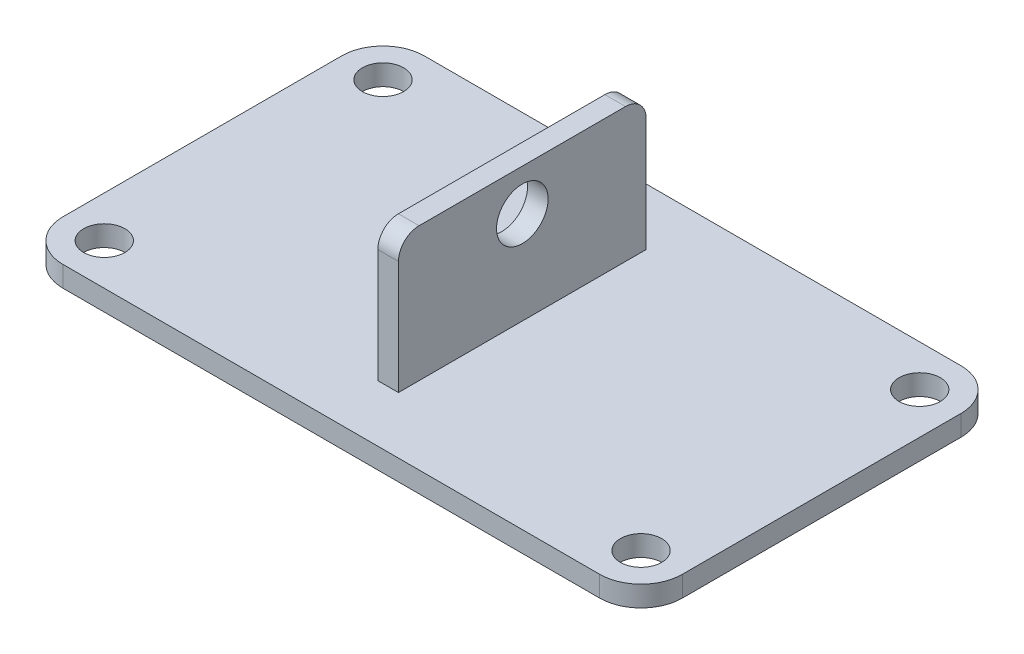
ISO-10303-21;
HEADER;
FILE_DESCRIPTION(('STEP AP214'),'2;1');
FILE_NAME('part.step','',(''),(''),'','','');
FILE_SCHEMA(('AUTOMOTIVE_DESIGN { 1 0 10303 214 1 1 1 1 }'));
ENDSEC;
DATA;
#1=APPLICATION_CONTEXT('core data for automotive mechanical design processes');
#2=APPLICATION_PROTOCOL_DEFINITION('international standard','automotive_design',2000,#1);
#3=PRODUCT_CONTEXT('',#1,'mechanical');
#4=PRODUCT('Part','Part','',(#3));
#5=PRODUCT_RELATED_PRODUCT_CATEGORY('part','',(#4));
#6=PRODUCT_DEFINITION_FORMATION('','',#4);
#7=PRODUCT_DEFINITION_CONTEXT('part definition',#1,'design');
#8=PRODUCT_DEFINITION('design','',#6,#7);
#9=PRODUCT_DEFINITION_SHAPE('','',#8);
#10=(LENGTH_UNIT() NAMED_UNIT(*) SI_UNIT(.MILLI.,.METRE.));
#11=(NAMED_UNIT(*) PLANE_ANGLE_UNIT() SI_UNIT($,.RADIAN.));
#12=(NAMED_UNIT(*) SI_UNIT($,.STERADIAN.) SOLID_ANGLE_UNIT());
#13=UNCERTAINTY_MEASURE_WITH_UNIT(LENGTH_MEASURE(1.E-05),#10,'distance_accuracy_value','');
#14=(GEOMETRIC_REPRESENTATION_CONTEXT(3) GLOBAL_UNCERTAINTY_ASSIGNED_CONTEXT((#13)) GLOBAL_UNIT_ASSIGNED_CONTEXT((#10,
#11,#12)) REPRESENTATION_CONTEXT('',''));
#15=CARTESIAN_POINT('',(0.,0.,0.));
#16=DIRECTION('',(0.,0.,1.));
#17=DIRECTION('',(1.,0.,0.));
#18=AXIS2_PLACEMENT_3D('',#15,#16,#17);
#19=CARTESIAN_POINT('',(130.,10.,-67.5));
#20=DIRECTION('',(0.,1.,0.));
#21=DIRECTION('',(0.,0.,1.));
#22=AXIS2_PLACEMENT_3D('',#19,#20,#21);
#23=PLANE('',#22);
#24=CARTESIAN_POINT('',(-130.,10.,-67.5));
#25=DIRECTION('',(0.,1.,0.));
#26=DIRECTION('',(0.,0.,1.));
#27=AXIS2_PLACEMENT_3D('',#24,#25,#26);
#28=CIRCLE('',#27,9.99999999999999);
#29=CARTESIAN_POINT('',(-130.,10.,-57.5));
#30=VERTEX_POINT('',#29);
#31=EDGE_CURVE('E240',#30,#30,#28,.T.);
#32=ORIENTED_EDGE('',*,*,#31,.F.);
#33=EDGE_LOOP('',(#32));
#34=FACE_BOUND('',#33,.T.);
#35=CARTESIAN_POINT('',(130.,10.,-67.5));
#36=DIRECTION('',(0.,1.,0.));
#37=DIRECTION('',(0.,0.,1.));
#38=AXIS2_PLACEMENT_3D('',#35,#36,#37);
#39=CIRCLE('',#38,10.);
#40=CARTESIAN_POINT('',(130.,10.,-57.5));
#41=VERTEX_POINT('',#40);
#42=EDGE_CURVE('E164',#41,#41,#39,.T.);
#43=ORIENTED_EDGE('',*,*,#42,.F.);
#44=EDGE_LOOP('',(#43));
#45=FACE_BOUND('',#44,.T.);
#46=CARTESIAN_POINT('',(130.,10.,-67.5));
#47=DIRECTION('',(0.,1.,0.));
#48=DIRECTION('',(0.,0.,1.));
#49=AXIS2_PLACEMENT_3D('',#46,#47,#48);
#50=CIRCLE('',#49,20.);
#51=CARTESIAN_POINT('',(150.,10.,-67.4999999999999));
#52=VERTEX_POINT('',#51);
#53=CARTESIAN_POINT('',(130.,10.,-87.5));
#54=VERTEX_POINT('',#53);
#55=EDGE_CURVE('E183',#52,#54,#50,.T.);
#56=ORIENTED_EDGE('',*,*,#55,.T.);
#57=DIRECTION('',(-1.,0.,0.));
#58=VECTOR('',#57,1.);
#59=CARTESIAN_POINT('',(-130.,10.,-87.5));
#60=LINE('',#59,#58);
#61=CARTESIAN_POINT('',(-130.,10.,-87.5));
#62=VERTEX_POINT('',#61);
#63=EDGE_CURVE('E111',#54,#62,#60,.T.);
#64=ORIENTED_EDGE('',*,*,#63,.T.);
#65=CARTESIAN_POINT('',(-130.,10.,-67.5));
#66=DIRECTION('',(0.,1.,0.));
#67=DIRECTION('',(0.,0.,1.));
#68=AXIS2_PLACEMENT_3D('',#65,#66,#67);
#69=CIRCLE('',#68,20.);
#70=CARTESIAN_POINT('',(-150.,10.,-67.4999999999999));
#71=VERTEX_POINT('',#70);
#72=EDGE_CURVE('E204',#62,#71,#69,.T.);
#73=ORIENTED_EDGE('',*,*,#72,.T.);
#74=DIRECTION('',(0.,0.,1.));
#75=VECTOR('',#74,1.);
#76=CARTESIAN_POINT('',(-150.,10.,67.4999999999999));
#77=LINE('',#76,#75);
#78=CARTESIAN_POINT('',(-150.,10.,67.4999999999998));
#79=VERTEX_POINT('',#78);
#80=EDGE_CURVE('E218',#71,#79,#77,.T.);
#81=ORIENTED_EDGE('',*,*,#80,.T.);
#82=CARTESIAN_POINT('',(-130.,10.,67.5));
#83=DIRECTION('',(0.,1.,0.));
#84=DIRECTION('',(0.,0.,1.));
#85=AXIS2_PLACEMENT_3D('',#82,#83,#84);
#86=CIRCLE('',#85,20.);
#87=CARTESIAN_POINT('',(-130.,10.,87.5));
#88=VERTEX_POINT('',#87);
#89=EDGE_CURVE('E134',#79,#88,#86,.T.);
#90=ORIENTED_EDGE('',*,*,#89,.T.);
#91=DIRECTION('',(1.,0.,0.));
#92=VECTOR('',#91,1.);
#93=CARTESIAN_POINT('',(-130.,10.,87.5));
#94=LINE('',#93,#92);
#95=CARTESIAN_POINT('',(130.,10.,87.5));
#96=VERTEX_POINT('',#95);
#97=EDGE_CURVE('E127',#88,#96,#94,.T.);
#98=ORIENTED_EDGE('',*,*,#97,.T.);
#99=CARTESIAN_POINT('',(130.,10.,67.5));
#100=DIRECTION('',(0.,1.,0.));
#101=DIRECTION('',(0.,0.,1.));
#102=AXIS2_PLACEMENT_3D('',#99,#100,#101);
#103=CIRCLE('',#102,20.);
#104=CARTESIAN_POINT('',(150.,10.,67.4999999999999));
#105=VERTEX_POINT('',#104);
#106=EDGE_CURVE('E131',#96,#105,#103,.T.);
#107=ORIENTED_EDGE('',*,*,#106,.T.);
#108=DIRECTION('',(0.,0.,-1.));
#109=VECTOR('',#108,1.);
#110=CARTESIAN_POINT('',(150.,10.,67.4999999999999));
#111=LINE('',#110,#109);
#112=EDGE_CURVE('E70',#105,#52,#111,.T.);
#113=ORIENTED_EDGE('',*,*,#112,.T.);
#114=EDGE_LOOP('',(#56,#64,#73,#81,#90,#98,#107,#113));
#115=FACE_BOUND('',#114,.T.);
#116=CARTESIAN_POINT('',(130.,10.,67.5));
#117=DIRECTION('',(0.,1.,0.));
#118=DIRECTION('',(0.,0.,1.));
#119=AXIS2_PLACEMENT_3D('',#116,#117,#118);
#120=CIRCLE('',#119,10.);
#121=CARTESIAN_POINT('',(130.,10.,77.5));
#122=VERTEX_POINT('',#121);
#123=EDGE_CURVE('E232',#122,#122,#120,.T.);
#124=ORIENTED_EDGE('',*,*,#123,.F.);
#125=EDGE_LOOP('',(#124));
#126=FACE_BOUND('',#125,.T.);
#127=CARTESIAN_POINT('',(-130.,10.,67.5));
#128=DIRECTION('',(0.,1.,0.));
#129=DIRECTION('',(0.,0.,1.));
#130=AXIS2_PLACEMENT_3D('',#127,#128,#129);
#131=CIRCLE('',#130,9.99999999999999);
#132=CARTESIAN_POINT('',(-130.,10.,77.5));
#133=VERTEX_POINT('',#132);
#134=EDGE_CURVE('E248',#133,#133,#131,.T.);
#135=ORIENTED_EDGE('',*,*,#134,.F.);
#136=EDGE_LOOP('',(#135));
#137=FACE_BOUND('',#136,.T.);
#138=DIRECTION('',(0.,0.,-1.));
#139=VECTOR('',#138,1.);
#140=CARTESIAN_POINT('',(5.,10.,60.));
#141=LINE('',#140,#139);
#142=CARTESIAN_POINT('',(5.,10.,60.));
#143=VERTEX_POINT('',#142);
#144=CARTESIAN_POINT('',(5.,10.,-60.));
#145=VERTEX_POINT('',#144);
#146=EDGE_CURVE('E322',#143,#145,#141,.T.);
#147=ORIENTED_EDGE('',*,*,#146,.F.);
#148=DIRECTION('',(-1.,0.,0.));
#149=VECTOR('',#148,1.);
#150=CARTESIAN_POINT('',(5.,10.,60.));
#151=LINE('',#150,#149);
#152=CARTESIAN_POINT('',(-5.,10.,60.));
#153=VERTEX_POINT('',#152);
#154=EDGE_CURVE('E256',#143,#153,#151,.T.);
#155=ORIENTED_EDGE('',*,*,#154,.T.);
#156=DIRECTION('',(0.,0.,-1.));
#157=VECTOR('',#156,1.);
#158=CARTESIAN_POINT('',(-5.,10.,60.));
#159=LINE('',#158,#157);
#160=CARTESIAN_POINT('',(-5.,10.,-60.));
#161=VERTEX_POINT('',#160);
#162=EDGE_CURVE('E300',#153,#161,#159,.T.);
#163=ORIENTED_EDGE('',*,*,#162,.T.);
#164=DIRECTION('',(-1.,0.,0.));
#165=VECTOR('',#164,1.);
#166=CARTESIAN_POINT('',(5.,10.,-60.));
#167=LINE('',#166,#165);
#168=EDGE_CURVE('E263',#145,#161,#167,.T.);
#169=ORIENTED_EDGE('',*,*,#168,.F.);
#170=EDGE_LOOP('',(#147,#155,#163,#169));
#171=FACE_BOUND('',#170,.T.);
#172=ADVANCED_FACE('F45',(#34,#45,#115,#126,#137,#171),#23,.T.);
#173=CARTESIAN_POINT('',(130.,0.,-67.5));
#174=DIRECTION('',(0.,1.,0.));
#175=DIRECTION('',(0.,0.,1.));
#176=AXIS2_PLACEMENT_3D('',#173,#174,#175);
#177=PLANE('',#176);
#178=CARTESIAN_POINT('',(130.,0.,-67.5));
#179=DIRECTION('',(0.,1.,0.));
#180=DIRECTION('',(0.,0.,1.));
#181=AXIS2_PLACEMENT_3D('',#178,#179,#180);
#182=CIRCLE('',#181,20.);
#183=CARTESIAN_POINT('',(150.,0.,-67.4999999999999));
#184=VERTEX_POINT('',#183);
#185=CARTESIAN_POINT('',(130.,0.,-87.5));
#186=VERTEX_POINT('',#185);
#187=EDGE_CURVE('E159',#184,#186,#182,.T.);
#188=ORIENTED_EDGE('',*,*,#187,.F.);
#189=DIRECTION('',(0.,0.,-1.));
#190=VECTOR('',#189,1.);
#191=CARTESIAN_POINT('',(150.,0.,67.4999999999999));
#192=LINE('',#191,#190);
#193=CARTESIAN_POINT('',(150.,0.,67.4999999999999));
#194=VERTEX_POINT('',#193);
#195=EDGE_CURVE('E103',#194,#184,#192,.T.);
#196=ORIENTED_EDGE('',*,*,#195,.F.);
#197=CARTESIAN_POINT('',(130.,0.,67.5));
#198=DIRECTION('',(0.,1.,0.));
#199=DIRECTION('',(0.,0.,1.));
#200=AXIS2_PLACEMENT_3D('',#197,#198,#199);
#201=CIRCLE('',#200,20.);
#202=CARTESIAN_POINT('',(130.,0.,87.5));
#203=VERTEX_POINT('',#202);
#204=EDGE_CURVE('E178',#203,#194,#201,.T.);
#205=ORIENTED_EDGE('',*,*,#204,.F.);
#206=DIRECTION('',(1.,0.,0.));
#207=VECTOR('',#206,1.);
#208=CARTESIAN_POINT('',(-130.,0.,87.5));
#209=LINE('',#208,#207);
#210=CARTESIAN_POINT('',(-130.,0.,87.5));
#211=VERTEX_POINT('',#210);
#212=EDGE_CURVE('E144',#211,#203,#209,.T.);
#213=ORIENTED_EDGE('',*,*,#212,.F.);
#214=CARTESIAN_POINT('',(-130.,0.,67.5));
#215=DIRECTION('',(0.,1.,0.));
#216=DIRECTION('',(0.,0.,1.));
#217=AXIS2_PLACEMENT_3D('',#214,#215,#216);
#218=CIRCLE('',#217,20.);
#219=CARTESIAN_POINT('',(-150.,0.,67.4999999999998));
#220=VERTEX_POINT('',#219);
#221=EDGE_CURVE('E173',#220,#211,#218,.T.);
#222=ORIENTED_EDGE('',*,*,#221,.F.);
#223=DIRECTION('',(0.,0.,1.));
#224=VECTOR('',#223,1.);
#225=CARTESIAN_POINT('',(-150.,0.,67.4999999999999));
#226=LINE('',#225,#224);
#227=CARTESIAN_POINT('',(-150.,0.,-67.4999999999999));
#228=VERTEX_POINT('',#227);
#229=EDGE_CURVE('E170',#228,#220,#226,.T.);
#230=ORIENTED_EDGE('',*,*,#229,.F.);
#231=CARTESIAN_POINT('',(-130.,0.,-67.5));
#232=DIRECTION('',(0.,1.,0.));
#233=DIRECTION('',(0.,0.,1.));
#234=AXIS2_PLACEMENT_3D('',#231,#232,#233);
#235=CIRCLE('',#234,20.);
#236=CARTESIAN_POINT('',(-130.,0.,-87.5));
#237=VERTEX_POINT('',#236);
#238=EDGE_CURVE('E167',#237,#228,#235,.T.);
#239=ORIENTED_EDGE('',*,*,#238,.F.);
#240=DIRECTION('',(-1.,0.,0.));
#241=VECTOR('',#240,1.);
#242=CARTESIAN_POINT('',(-130.,0.,-87.5));
#243=LINE('',#242,#241);
#244=EDGE_CURVE('E163',#186,#237,#243,.T.);
#245=ORIENTED_EDGE('',*,*,#244,.F.);
#246=EDGE_LOOP('',(#188,#196,#205,#213,#222,#230,#239,#245));
#247=FACE_BOUND('',#246,.T.);
#248=CARTESIAN_POINT('',(130.,0.,-67.5));
#249=DIRECTION('',(0.,1.,0.));
#250=DIRECTION('',(0.,0.,1.));
#251=AXIS2_PLACEMENT_3D('',#248,#249,#250);
#252=CIRCLE('',#251,10.);
#253=CARTESIAN_POINT('',(130.,0.,-57.5));
#254=VERTEX_POINT('',#253);
#255=EDGE_CURVE('E228',#254,#254,#252,.T.);
#256=ORIENTED_EDGE('',*,*,#255,.T.);
#257=EDGE_LOOP('',(#256));
#258=FACE_BOUND('',#257,.T.);
#259=CARTESIAN_POINT('',(130.,0.,67.5));
#260=DIRECTION('',(0.,1.,0.));
#261=DIRECTION('',(0.,0.,1.));
#262=AXIS2_PLACEMENT_3D('',#259,#260,#261);
#263=CIRCLE('',#262,10.);
#264=CARTESIAN_POINT('',(130.,0.,77.5));
#265=VERTEX_POINT('',#264);
#266=EDGE_CURVE('E236',#265,#265,#263,.T.);
#267=ORIENTED_EDGE('',*,*,#266,.T.);
#268=EDGE_LOOP('',(#267));
#269=FACE_BOUND('',#268,.T.);
#270=CARTESIAN_POINT('',(-130.,0.,-67.5));
#271=DIRECTION('',(0.,1.,0.));
#272=DIRECTION('',(0.,0.,1.));
#273=AXIS2_PLACEMENT_3D('',#270,#271,#272);
#274=CIRCLE('',#273,9.99999999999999);
#275=CARTESIAN_POINT('',(-130.,0.,-57.5));
#276=VERTEX_POINT('',#275);
#277=EDGE_CURVE('E244',#276,#276,#274,.T.);
#278=ORIENTED_EDGE('',*,*,#277,.T.);
#279=EDGE_LOOP('',(#278));
#280=FACE_BOUND('',#279,.T.);
#281=CARTESIAN_POINT('',(-130.,0.,67.5));
#282=DIRECTION('',(0.,1.,0.));
#283=DIRECTION('',(0.,0.,1.));
#284=AXIS2_PLACEMENT_3D('',#281,#282,#283);
#285=CIRCLE('',#284,9.99999999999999);
#286=CARTESIAN_POINT('',(-130.,0.,77.5));
#287=VERTEX_POINT('',#286);
#288=EDGE_CURVE('E252',#287,#287,#285,.T.);
#289=ORIENTED_EDGE('',*,*,#288,.T.);
#290=EDGE_LOOP('',(#289));
#291=FACE_BOUND('',#290,.T.);
#292=ADVANCED_FACE('F208',(#247,#258,#269,#280,#291),#177,.F.);
#293=CARTESIAN_POINT('',(130.,10.,-67.5));
#294=DIRECTION('',(0.,-1.,0.));
#295=DIRECTION('',(0.,0.,-1.));
#296=AXIS2_PLACEMENT_3D('',#293,#294,#295);
#297=CYLINDRICAL_SURFACE('',#296,20.);
#298=ORIENTED_EDGE('',*,*,#187,.T.);
#299=DIRECTION('',(0.,-1.,0.));
#300=VECTOR('',#299,1.);
#301=CARTESIAN_POINT('',(130.,10.,-87.5));
#302=LINE('',#301,#300);
#303=EDGE_CURVE('E11',#54,#186,#302,.T.);
#304=ORIENTED_EDGE('',*,*,#303,.F.);
#305=ORIENTED_EDGE('',*,*,#55,.F.);
#306=DIRECTION('',(0.,-1.,0.));
#307=VECTOR('',#306,1.);
#308=CARTESIAN_POINT('',(150.,10.,-67.4999999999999));
#309=LINE('',#308,#307);
#310=EDGE_CURVE('E155',#52,#184,#309,.T.);
#311=ORIENTED_EDGE('',*,*,#310,.T.);
#312=EDGE_LOOP('',(#298,#304,#305,#311));
#313=FACE_BOUND('',#312,.T.);
#314=ADVANCED_FACE('F47',(#313),#297,.T.);
#315=CARTESIAN_POINT('',(-130.,10.,-87.5));
#316=DIRECTION('',(0.,0.,1.));
#317=DIRECTION('',(1.,0.,0.));
#318=AXIS2_PLACEMENT_3D('',#315,#316,#317);
#319=PLANE('',#318);
#320=ORIENTED_EDGE('',*,*,#244,.T.);
#321=DIRECTION('',(0.,-1.,0.));
#322=VECTOR('',#321,1.);
#323=CARTESIAN_POINT('',(-130.,10.,-87.5));
#324=LINE('',#323,#322);
#325=EDGE_CURVE('E54',#62,#237,#324,.T.);
#326=ORIENTED_EDGE('',*,*,#325,.F.);
#327=ORIENTED_EDGE('',*,*,#63,.F.);
#328=ORIENTED_EDGE('',*,*,#303,.T.);
#329=EDGE_LOOP('',(#320,#326,#327,#328));
#330=FACE_BOUND('',#329,.T.);
#331=ADVANCED_FACE('F381',(#330),#319,.F.);
#332=CARTESIAN_POINT('',(-130.,10.,-67.5));
#333=DIRECTION('',(0.,-1.,0.));
#334=DIRECTION('',(0.,0.,-1.));
#335=AXIS2_PLACEMENT_3D('',#332,#333,#334);
#336=CYLINDRICAL_SURFACE('',#335,20.);
#337=ORIENTED_EDGE('',*,*,#238,.T.);
#338=DIRECTION('',(0.,-1.,0.));
#339=VECTOR('',#338,1.);
#340=CARTESIAN_POINT('',(-150.,10.,-67.4999999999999));
#341=LINE('',#340,#339);
#342=EDGE_CURVE('E194',#71,#228,#341,.T.);
#343=ORIENTED_EDGE('',*,*,#342,.F.);
#344=ORIENTED_EDGE('',*,*,#72,.F.);
#345=ORIENTED_EDGE('',*,*,#325,.T.);
#346=EDGE_LOOP('',(#337,#343,#344,#345));
#347=FACE_BOUND('',#346,.T.);
#348=ADVANCED_FACE('F202',(#347),#336,.T.);
#349=CARTESIAN_POINT('',(-150.,10.,67.4999999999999));
#350=DIRECTION('',(1.,0.,0.));
#351=DIRECTION('',(0.,0.,-1.));
#352=AXIS2_PLACEMENT_3D('',#349,#350,#351);
#353=PLANE('',#352);
#354=ORIENTED_EDGE('',*,*,#229,.T.);
#355=DIRECTION('',(0.,-1.,0.));
#356=VECTOR('',#355,1.);
#357=CARTESIAN_POINT('',(-150.,10.,67.4999999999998));
#358=LINE('',#357,#356);
#359=EDGE_CURVE('E190',#79,#220,#358,.T.);
#360=ORIENTED_EDGE('',*,*,#359,.F.);
#361=ORIENTED_EDGE('',*,*,#80,.F.);
#362=ORIENTED_EDGE('',*,*,#342,.T.);
#363=EDGE_LOOP('',(#354,#360,#361,#362));
#364=FACE_BOUND('',#363,.T.);
#365=ADVANCED_FACE('F213',(#364),#353,.F.);
#366=CARTESIAN_POINT('',(-130.,10.,67.5));
#367=DIRECTION('',(0.,-1.,0.));
#368=DIRECTION('',(0.,0.,-1.));
#369=AXIS2_PLACEMENT_3D('',#366,#367,#368);
#370=CYLINDRICAL_SURFACE('',#369,20.);
#371=ORIENTED_EDGE('',*,*,#221,.T.);
#372=DIRECTION('',(0.,-1.,0.));
#373=VECTOR('',#372,1.);
#374=CARTESIAN_POINT('',(-130.,10.,87.5));
#375=LINE('',#374,#373);
#376=EDGE_CURVE('E148',#88,#211,#375,.T.);
#377=ORIENTED_EDGE('',*,*,#376,.F.);
#378=ORIENTED_EDGE('',*,*,#89,.F.);
#379=ORIENTED_EDGE('',*,*,#359,.T.);
#380=EDGE_LOOP('',(#371,#377,#378,#379));
#381=FACE_BOUND('',#380,.T.);
#382=ADVANCED_FACE('F216',(#381),#370,.T.);
#383=CARTESIAN_POINT('',(-130.,10.,87.5));
#384=DIRECTION('',(0.,0.,-1.));
#385=DIRECTION('',(-1.,0.,0.));
#386=AXIS2_PLACEMENT_3D('',#383,#384,#385);
#387=PLANE('',#386);
#388=ORIENTED_EDGE('',*,*,#212,.T.);
#389=DIRECTION('',(0.,-1.,0.));
#390=VECTOR('',#389,1.);
#391=CARTESIAN_POINT('',(130.,10.,87.5));
#392=LINE('',#391,#390);
#393=EDGE_CURVE('E141',#96,#203,#392,.T.);
#394=ORIENTED_EDGE('',*,*,#393,.F.);
#395=ORIENTED_EDGE('',*,*,#97,.F.);
#396=ORIENTED_EDGE('',*,*,#376,.T.);
#397=EDGE_LOOP('',(#388,#394,#395,#396));
#398=FACE_BOUND('',#397,.T.);
#399=ADVANCED_FACE('F142',(#398),#387,.F.);
#400=CARTESIAN_POINT('',(130.,10.,67.5));
#401=DIRECTION('',(0.,-1.,0.));
#402=DIRECTION('',(0.,0.,-1.));
#403=AXIS2_PLACEMENT_3D('',#400,#401,#402);
#404=CYLINDRICAL_SURFACE('',#403,20.);
#405=ORIENTED_EDGE('',*,*,#204,.T.);
#406=DIRECTION('',(0.,-1.,0.));
#407=VECTOR('',#406,1.);
#408=CARTESIAN_POINT('',(150.,10.,67.4999999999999));
#409=LINE('',#408,#407);
#410=EDGE_CURVE('E149',#105,#194,#409,.T.);
#411=ORIENTED_EDGE('',*,*,#410,.F.);
#412=ORIENTED_EDGE('',*,*,#106,.F.);
#413=ORIENTED_EDGE('',*,*,#393,.T.);
#414=EDGE_LOOP('',(#405,#411,#412,#413));
#415=FACE_BOUND('',#414,.T.);
#416=ADVANCED_FACE('F151',(#415),#404,.T.);
#417=CARTESIAN_POINT('',(150.,10.,67.4999999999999));
#418=DIRECTION('',(-1.,0.,0.));
#419=DIRECTION('',(0.,0.,1.));
#420=AXIS2_PLACEMENT_3D('',#417,#418,#419);
#421=PLANE('',#420);
#422=ORIENTED_EDGE('',*,*,#195,.T.);
#423=ORIENTED_EDGE('',*,*,#310,.F.);
#424=ORIENTED_EDGE('',*,*,#112,.F.);
#425=ORIENTED_EDGE('',*,*,#410,.T.);
#426=EDGE_LOOP('',(#422,#423,#424,#425));
#427=FACE_BOUND('',#426,.T.);
#428=ADVANCED_FACE('F369',(#427),#421,.F.);
#429=CARTESIAN_POINT('',(130.,10.,-67.5));
#430=DIRECTION('',(0.,-1.,0.));
#431=DIRECTION('',(0.,0.,-1.));
#432=AXIS2_PLACEMENT_3D('',#429,#430,#431);
#433=CYLINDRICAL_SURFACE('',#432,10.);
#434=ORIENTED_EDGE('',*,*,#42,.T.);
#435=EDGE_LOOP('',(#434));
#436=FACE_BOUND('',#435,.T.);
#437=ORIENTED_EDGE('',*,*,#255,.F.);
#438=EDGE_LOOP('',(#437));
#439=FACE_BOUND('',#438,.T.);
#440=ADVANCED_FACE('F366',(#436,#439),#433,.F.);
#441=CARTESIAN_POINT('',(130.,10.,67.5));
#442=DIRECTION('',(0.,-1.,0.));
#443=DIRECTION('',(0.,0.,-1.));
#444=AXIS2_PLACEMENT_3D('',#441,#442,#443);
#445=CYLINDRICAL_SURFACE('',#444,10.);
#446=ORIENTED_EDGE('',*,*,#123,.T.);
#447=EDGE_LOOP('',(#446));
#448=FACE_BOUND('',#447,.T.);
#449=ORIENTED_EDGE('',*,*,#266,.F.);
#450=EDGE_LOOP('',(#449));
#451=FACE_BOUND('',#450,.T.);
#452=ADVANCED_FACE('F440',(#448,#451),#445,.F.);
#453=CARTESIAN_POINT('',(-130.,10.,-67.5));
#454=DIRECTION('',(0.,-1.,0.));
#455=DIRECTION('',(0.,0.,-1.));
#456=AXIS2_PLACEMENT_3D('',#453,#454,#455);
#457=CYLINDRICAL_SURFACE('',#456,9.99999999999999);
#458=ORIENTED_EDGE('',*,*,#31,.T.);
#459=EDGE_LOOP('',(#458));
#460=FACE_BOUND('',#459,.T.);
#461=ORIENTED_EDGE('',*,*,#277,.F.);
#462=EDGE_LOOP('',(#461));
#463=FACE_BOUND('',#462,.T.);
#464=ADVANCED_FACE('F353',(#460,#463),#457,.F.);
#465=CARTESIAN_POINT('',(-130.,10.,67.5));
#466=DIRECTION('',(0.,-1.,0.));
#467=DIRECTION('',(0.,0.,-1.));
#468=AXIS2_PLACEMENT_3D('',#465,#466,#467);
#469=CYLINDRICAL_SURFACE('',#468,9.99999999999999);
#470=ORIENTED_EDGE('',*,*,#134,.T.);
#471=EDGE_LOOP('',(#470));
#472=FACE_BOUND('',#471,.T.);
#473=ORIENTED_EDGE('',*,*,#288,.F.);
#474=EDGE_LOOP('',(#473));
#475=FACE_BOUND('',#474,.T.);
#476=ADVANCED_FACE('F342',(#472,#475),#469,.F.);
#477=CARTESIAN_POINT('',(5.,65.,50.));
#478=DIRECTION('',(-1.,0.,0.));
#479=DIRECTION('',(0.,0.,1.));
#480=AXIS2_PLACEMENT_3D('',#477,#478,#479);
#481=PLANE('',#480);
#482=DIRECTION('',(0.,-1.,0.));
#483=VECTOR('',#482,1.);
#484=CARTESIAN_POINT('',(5.,10.,60.));
#485=LINE('',#484,#483);
#486=CARTESIAN_POINT('',(5.,65.,60.));
#487=VERTEX_POINT('',#486);
#488=EDGE_CURVE('E287',#487,#143,#485,.T.);
#489=ORIENTED_EDGE('',*,*,#488,.T.);
#490=ORIENTED_EDGE('',*,*,#146,.T.);
#491=DIRECTION('',(0.,1.,0.));
#492=VECTOR('',#491,1.);
#493=CARTESIAN_POINT('',(5.,10.,-60.));
#494=LINE('',#493,#492);
#495=CARTESIAN_POINT('',(5.,65.,-60.));
#496=VERTEX_POINT('',#495);
#497=EDGE_CURVE('E61',#145,#496,#494,.T.);
#498=ORIENTED_EDGE('',*,*,#497,.T.);
#499=CARTESIAN_POINT('',(5.,65.,-50.));
#500=DIRECTION('',(1.,0.,0.));
#501=DIRECTION('',(0.,0.,-1.));
#502=AXIS2_PLACEMENT_3D('',#499,#500,#501);
#503=CIRCLE('',#502,10.);
#504=CARTESIAN_POINT('',(5.,75.,-50.));
#505=VERTEX_POINT('',#504);
#506=EDGE_CURVE('E316',#496,#505,#503,.T.);
#507=ORIENTED_EDGE('',*,*,#506,.T.);
#508=DIRECTION('',(0.,0.,1.));
#509=VECTOR('',#508,1.);
#510=CARTESIAN_POINT('',(5.,75.,50.));
#511=LINE('',#510,#509);
#512=CARTESIAN_POINT('',(5.,75.,50.));
#513=VERTEX_POINT('',#512);
#514=EDGE_CURVE('E312',#505,#513,#511,.T.);
#515=ORIENTED_EDGE('',*,*,#514,.T.);
#516=CARTESIAN_POINT('',(5.,65.,50.));
#517=DIRECTION('',(1.,0.,0.));
#518=DIRECTION('',(0.,0.,1.));
#519=AXIS2_PLACEMENT_3D('',#516,#517,#518);
#520=CIRCLE('',#519,10.);
#521=EDGE_CURVE('E282',#513,#487,#520,.T.);
#522=ORIENTED_EDGE('',*,*,#521,.T.);
#523=EDGE_LOOP('',(#489,#490,#498,#507,#515,#522));
#524=FACE_BOUND('',#523,.T.);
#525=CARTESIAN_POINT('',(5.,55.,0.));
#526=DIRECTION('',(1.,0.,0.));
#527=DIRECTION('',(0.,0.,-1.));
#528=AXIS2_PLACEMENT_3D('',#525,#526,#527);
#529=CIRCLE('',#528,12.5);
#530=CARTESIAN_POINT('',(5.,55.,-12.5));
#531=VERTEX_POINT('',#530);
#532=EDGE_CURVE('E308',#531,#531,#529,.T.);
#533=ORIENTED_EDGE('',*,*,#532,.F.);
#534=EDGE_LOOP('',(#533));
#535=FACE_BOUND('',#534,.T.);
#536=ADVANCED_FACE('F339',(#524,#535),#481,.F.);
#537=CARTESIAN_POINT('',(-5.,65.,50.));
#538=DIRECTION('',(-1.,0.,0.));
#539=DIRECTION('',(0.,0.,1.));
#540=AXIS2_PLACEMENT_3D('',#537,#538,#539);
#541=PLANE('',#540);
#542=DIRECTION('',(0.,-1.,0.));
#543=VECTOR('',#542,1.);
#544=CARTESIAN_POINT('',(-5.,10.,60.));
#545=LINE('',#544,#543);
#546=CARTESIAN_POINT('',(-5.,65.,60.));
#547=VERTEX_POINT('',#546);
#548=EDGE_CURVE('E304',#547,#153,#545,.T.);
#549=ORIENTED_EDGE('',*,*,#548,.F.);
#550=CARTESIAN_POINT('',(-5.,65.,50.));
#551=DIRECTION('',(1.,0.,0.));
#552=DIRECTION('',(0.,0.,1.));
#553=AXIS2_PLACEMENT_3D('',#550,#551,#552);
#554=CIRCLE('',#553,10.);
#555=CARTESIAN_POINT('',(-5.,75.,50.));
#556=VERTEX_POINT('',#555);
#557=EDGE_CURVE('E283',#556,#547,#554,.T.);
#558=ORIENTED_EDGE('',*,*,#557,.F.);
#559=DIRECTION('',(0.,0.,1.));
#560=VECTOR('',#559,1.);
#561=CARTESIAN_POINT('',(-5.,75.,50.));
#562=LINE('',#561,#560);
#563=CARTESIAN_POINT('',(-5.,75.,-50.));
#564=VERTEX_POINT('',#563);
#565=EDGE_CURVE('E288',#564,#556,#562,.T.);
#566=ORIENTED_EDGE('',*,*,#565,.F.);
#567=CARTESIAN_POINT('',(-5.,65.,-50.));
#568=DIRECTION('',(1.,0.,0.));
#569=DIRECTION('',(0.,0.,-1.));
#570=AXIS2_PLACEMENT_3D('',#567,#568,#569);
#571=CIRCLE('',#570,10.);
#572=CARTESIAN_POINT('',(-5.,65.,-60.));
#573=VERTEX_POINT('',#572);
#574=EDGE_CURVE('E292',#573,#564,#571,.T.);
#575=ORIENTED_EDGE('',*,*,#574,.F.);
#576=DIRECTION('',(0.,1.,0.));
#577=VECTOR('',#576,1.);
#578=CARTESIAN_POINT('',(-5.,10.,-60.));
#579=LINE('',#578,#577);
#580=EDGE_CURVE('E296',#161,#573,#579,.T.);
#581=ORIENTED_EDGE('',*,*,#580,.F.);
#582=ORIENTED_EDGE('',*,*,#162,.F.);
#583=EDGE_LOOP('',(#549,#558,#566,#575,#581,#582));
#584=FACE_BOUND('',#583,.T.);
#585=CARTESIAN_POINT('',(-5.,55.,0.));
#586=DIRECTION('',(1.,0.,0.));
#587=DIRECTION('',(0.,0.,-1.));
#588=AXIS2_PLACEMENT_3D('',#585,#586,#587);
#589=CIRCLE('',#588,12.5);
#590=CARTESIAN_POINT('',(-5.,55.,-12.5));
#591=VERTEX_POINT('',#590);
#592=EDGE_CURVE('E328',#591,#591,#589,.T.);
#593=ORIENTED_EDGE('',*,*,#592,.T.);
#594=EDGE_LOOP('',(#593));
#595=FACE_BOUND('',#594,.T.);
#596=ADVANCED_FACE('F341',(#584,#595),#541,.T.);
#597=CARTESIAN_POINT('',(5.,10.,60.));
#598=DIRECTION('',(0.,0.,-1.));
#599=DIRECTION('',(0.,1.,0.));
#600=AXIS2_PLACEMENT_3D('',#597,#598,#599);
#601=PLANE('',#600);
#602=ORIENTED_EDGE('',*,*,#548,.T.);
#603=ORIENTED_EDGE('',*,*,#154,.F.);
#604=ORIENTED_EDGE('',*,*,#488,.F.);
#605=DIRECTION('',(-1.,0.,0.));
#606=VECTOR('',#605,1.);
#607=CARTESIAN_POINT('',(5.,65.,60.));
#608=LINE('',#607,#606);
#609=EDGE_CURVE('E278',#487,#547,#608,.T.);
#610=ORIENTED_EDGE('',*,*,#609,.T.);
#611=EDGE_LOOP('',(#602,#603,#604,#610));
#612=FACE_BOUND('',#611,.T.);
#613=ADVANCED_FACE('F349',(#612),#601,.F.);
#614=CARTESIAN_POINT('',(5.,10.,-60.));
#615=DIRECTION('',(0.,0.,1.));
#616=DIRECTION('',(1.,0.,0.));
#617=AXIS2_PLACEMENT_3D('',#614,#615,#616);
#618=PLANE('',#617);
#619=ORIENTED_EDGE('',*,*,#580,.T.);
#620=DIRECTION('',(-1.,0.,0.));
#621=VECTOR('',#620,1.);
#622=CARTESIAN_POINT('',(5.,65.,-60.));
#623=LINE('',#622,#621);
#624=EDGE_CURVE('E266',#496,#573,#623,.T.);
#625=ORIENTED_EDGE('',*,*,#624,.F.);
#626=ORIENTED_EDGE('',*,*,#497,.F.);
#627=ORIENTED_EDGE('',*,*,#168,.T.);
#628=EDGE_LOOP('',(#619,#625,#626,#627));
#629=FACE_BOUND('',#628,.T.);
#630=ADVANCED_FACE('F481',(#629),#618,.F.);
#631=CARTESIAN_POINT('',(5.,65.,-50.));
#632=DIRECTION('',(-1.,0.,0.));
#633=DIRECTION('',(0.,0.,1.));
#634=AXIS2_PLACEMENT_3D('',#631,#632,#633);
#635=CYLINDRICAL_SURFACE('',#634,10.);
#636=ORIENTED_EDGE('',*,*,#574,.T.);
#637=DIRECTION('',(-1.,0.,0.));
#638=VECTOR('',#637,1.);
#639=CARTESIAN_POINT('',(5.,75.,-50.));
#640=LINE('',#639,#638);
#641=EDGE_CURVE('E270',#505,#564,#640,.T.);
#642=ORIENTED_EDGE('',*,*,#641,.F.);
#643=ORIENTED_EDGE('',*,*,#506,.F.);
#644=ORIENTED_EDGE('',*,*,#624,.T.);
#645=EDGE_LOOP('',(#636,#642,#643,#644));
#646=FACE_BOUND('',#645,.T.);
#647=ADVANCED_FACE('F490',(#646),#635,.T.);
#648=CARTESIAN_POINT('',(5.,75.,50.));
#649=DIRECTION('',(0.,-1.,0.));
#650=DIRECTION('',(0.,0.,-1.));
#651=AXIS2_PLACEMENT_3D('',#648,#649,#650);
#652=PLANE('',#651);
#653=ORIENTED_EDGE('',*,*,#565,.T.);
#654=DIRECTION('',(-1.,0.,0.));
#655=VECTOR('',#654,1.);
#656=CARTESIAN_POINT('',(5.,75.,50.));
#657=LINE('',#656,#655);
#658=EDGE_CURVE('E274',#513,#556,#657,.T.);
#659=ORIENTED_EDGE('',*,*,#658,.F.);
#660=ORIENTED_EDGE('',*,*,#514,.F.);
#661=ORIENTED_EDGE('',*,*,#641,.T.);
#662=EDGE_LOOP('',(#653,#659,#660,#661));
#663=FACE_BOUND('',#662,.T.);
#664=ADVANCED_FACE('F498',(#663),#652,.F.);
#665=CARTESIAN_POINT('',(5.,65.,50.));
#666=DIRECTION('',(-1.,0.,0.));
#667=DIRECTION('',(0.,0.,1.));
#668=AXIS2_PLACEMENT_3D('',#665,#666,#667);
#669=CYLINDRICAL_SURFACE('',#668,10.);
#670=ORIENTED_EDGE('',*,*,#557,.T.);
#671=ORIENTED_EDGE('',*,*,#609,.F.);
#672=ORIENTED_EDGE('',*,*,#521,.F.);
#673=ORIENTED_EDGE('',*,*,#658,.T.);
#674=EDGE_LOOP('',(#670,#671,#672,#673));
#675=FACE_BOUND('',#674,.T.);
#676=ADVANCED_FACE('F507',(#675),#669,.T.);
#677=CARTESIAN_POINT('',(5.,55.,0.));
#678=DIRECTION('',(-1.,0.,0.));
#679=DIRECTION('',(0.,0.,1.));
#680=AXIS2_PLACEMENT_3D('',#677,#678,#679);
#681=CYLINDRICAL_SURFACE('',#680,12.5);
#682=ORIENTED_EDGE('',*,*,#532,.T.);
#683=EDGE_LOOP('',(#682));
#684=FACE_BOUND('',#683,.T.);
#685=ORIENTED_EDGE('',*,*,#592,.F.);
#686=EDGE_LOOP('',(#685));
#687=FACE_BOUND('',#686,.T.);
#688=ADVANCED_FACE('F336',(#684,#687),#681,.F.);
#689=CLOSED_SHELL('',(#172,#292,#314,#331,#348,#365,#382,#399,#416,#428,#440,#452,#464,#476,
#536,#596,#613,#630,#647,#664,#676,#688));
#690=MANIFOLD_SOLID_BREP('B2',#689);
#691=ADVANCED_BREP_SHAPE_REPRESENTATION('',(#18,#690),#14);
#692=SHAPE_DEFINITION_REPRESENTATION(#9,#691);
ENDSEC;
END-ISO-10303-21;
